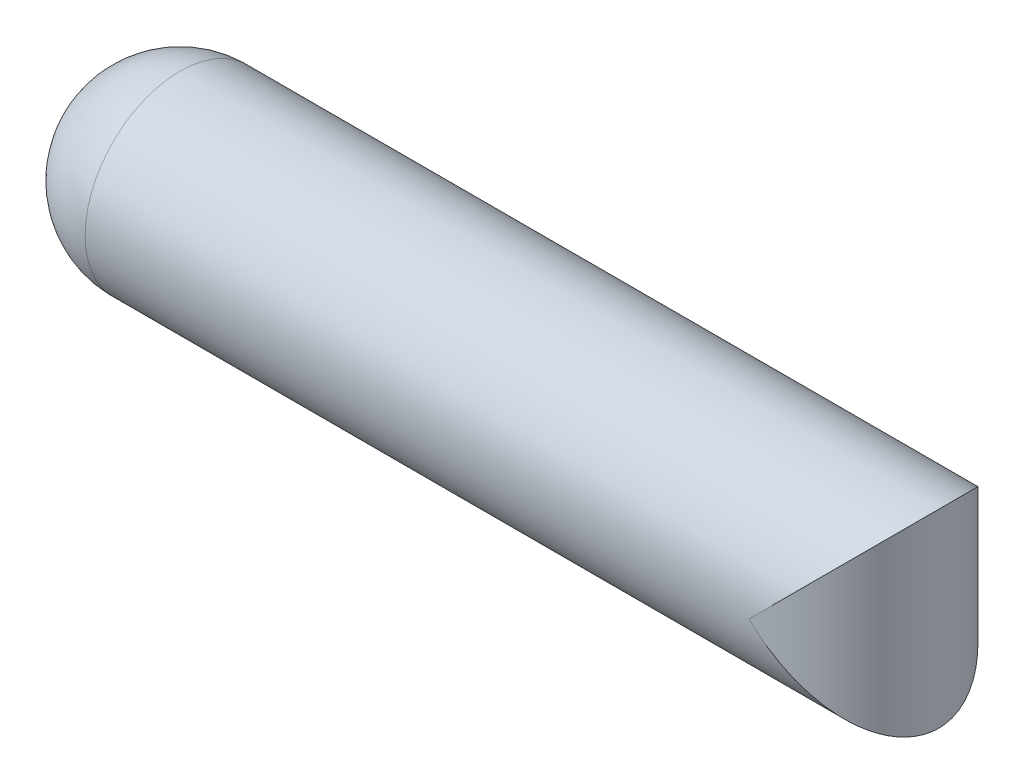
ISO-10303-21;
HEADER;
FILE_DESCRIPTION(('STEP AP214'),'2;1');
FILE_NAME('part.step','',(''),(''),'','','');
FILE_SCHEMA(('AUTOMOTIVE_DESIGN { 1 0 10303 214 1 1 1 1 }'));
ENDSEC;
DATA;
#1=APPLICATION_CONTEXT('core data for automotive mechanical design processes');
#2=APPLICATION_PROTOCOL_DEFINITION('international standard','automotive_design',2000,#1);
#3=PRODUCT_CONTEXT('',#1,'mechanical');
#4=PRODUCT('Part','Part','',(#3));
#5=PRODUCT_RELATED_PRODUCT_CATEGORY('part','',(#4));
#6=PRODUCT_DEFINITION_FORMATION('','',#4);
#7=PRODUCT_DEFINITION_CONTEXT('part definition',#1,'design');
#8=PRODUCT_DEFINITION('design','',#6,#7);
#9=PRODUCT_DEFINITION_SHAPE('','',#8);
#10=(LENGTH_UNIT() NAMED_UNIT(*) SI_UNIT(.MILLI.,.METRE.));
#11=(NAMED_UNIT(*) PLANE_ANGLE_UNIT() SI_UNIT($,.RADIAN.));
#12=(NAMED_UNIT(*) SI_UNIT($,.STERADIAN.) SOLID_ANGLE_UNIT());
#13=UNCERTAINTY_MEASURE_WITH_UNIT(LENGTH_MEASURE(1.E-05),#10,'distance_accuracy_value','');
#14=(GEOMETRIC_REPRESENTATION_CONTEXT(3) GLOBAL_UNCERTAINTY_ASSIGNED_CONTEXT((#13)) GLOBAL_UNIT_ASSIGNED_CONTEXT((#10,
#11,#12)) REPRESENTATION_CONTEXT('',''));
#15=CARTESIAN_POINT('',(0.,0.,0.));
#16=DIRECTION('',(0.,0.,1.));
#17=DIRECTION('',(1.,0.,0.));
#18=AXIS2_PLACEMENT_3D('',#15,#16,#17);
#19=CARTESIAN_POINT('',(457.2,0.,0.));
#20=DIRECTION('',(-1.,0.,0.));
#21=DIRECTION('',(0.,0.,1.));
#22=AXIS2_PLACEMENT_3D('',#19,#20,#21);
#23=CYLINDRICAL_SURFACE('',#22,50.8);
#24=CARTESIAN_POINT('',(50.8,0.,0.));
#25=DIRECTION('',(-1.,0.,0.));
#26=DIRECTION('',(0.,0.,1.));
#27=AXIS2_PLACEMENT_3D('',#24,#25,#26);
#28=CIRCLE('',#27,50.8);
#29=CARTESIAN_POINT('',(50.8,0.,50.8));
#30=VERTEX_POINT('',#29);
#31=EDGE_CURVE('E11',#30,#30,#28,.F.);
#32=ORIENTED_EDGE('',*,*,#31,.T.);
#33=EDGE_LOOP('',(#32));
#34=FACE_BOUND('',#33,.T.);
#35=CARTESIAN_POINT('',(406.4,0.,0.));
#36=DIRECTION('',(-0.707106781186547,-0.707106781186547,0.));
#37=DIRECTION('',(-0.707106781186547,0.707106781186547,0.));
#38=AXIS2_PLACEMENT_3D('',#35,#36,#37);
#39=ELLIPSE('',#38,71.8420489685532,50.8);
#40=CARTESIAN_POINT('',(406.4,0.,-50.8));
#41=VERTEX_POINT('',#40);
#42=CARTESIAN_POINT('',(406.4,0.,50.8));
#43=VERTEX_POINT('',#42);
#44=EDGE_CURVE('E41',#41,#43,#39,.T.);
#45=ORIENTED_EDGE('',*,*,#44,.T.);
#46=CARTESIAN_POINT('',(406.4,0.,0.));
#47=DIRECTION('',(-0.707106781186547,0.707106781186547,0.));
#48=DIRECTION('',(-0.707106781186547,-0.707106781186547,0.));
#49=AXIS2_PLACEMENT_3D('',#46,#47,#48);
#50=ELLIPSE('',#49,71.8420489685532,50.8);
#51=EDGE_CURVE('E47',#43,#41,#50,.T.);
#52=ORIENTED_EDGE('',*,*,#51,.T.);
#53=EDGE_LOOP('',(#45,#52));
#54=FACE_BOUND('',#53,.T.);
#55=ADVANCED_FACE('F33',(#34,#54),#23,.T.);
#56=CARTESIAN_POINT('',(50.8,0.,0.));
#57=DIRECTION('',(0.,0.,1.));
#58=DIRECTION('',(1.,0.,0.));
#59=AXIS2_PLACEMENT_3D('',#56,#57,#58);
#60=SPHERICAL_SURFACE('',#59,50.8);
#61=CARTESIAN_POINT('',(50.8,0.,0.));
#62=DIRECTION('',(-1.,0.,0.));
#63=DIRECTION('',(0.,0.,1.));
#64=AXIS2_PLACEMENT_3D('',#61,#62,#63);
#65=SPHERICAL_SURFACE('',#64,50.8);
#66=ORIENTED_EDGE('',*,*,#31,.F.);
#67=EDGE_LOOP('',(#66));
#68=FACE_BOUND('',#67,.T.);
#69=ADVANCED_FACE('F35',(#68),#65,.T.);
#70=CARTESIAN_POINT('',(406.4,-50.8,0.));
#71=DIRECTION('',(0.,1.,0.));
#72=DIRECTION('',(0.,0.,1.));
#73=AXIS2_PLACEMENT_3D('',#70,#71,#72);
#74=CYLINDRICAL_SURFACE('',#73,50.8);
#75=ORIENTED_EDGE('',*,*,#51,.F.);
#76=ORIENTED_EDGE('',*,*,#44,.F.);
#77=EDGE_LOOP('',(#75,#76));
#78=FACE_BOUND('',#77,.T.);
#79=ADVANCED_FACE('F49',(#78),#74,.T.);
#80=CLOSED_SHELL('',(#55,#69,#79));
#81=MANIFOLD_SOLID_BREP('B2',#80);
#82=ADVANCED_BREP_SHAPE_REPRESENTATION('',(#18,#81),#14);
#83=SHAPE_DEFINITION_REPRESENTATION(#9,#82);
ENDSEC;
END-ISO-10303-21;
